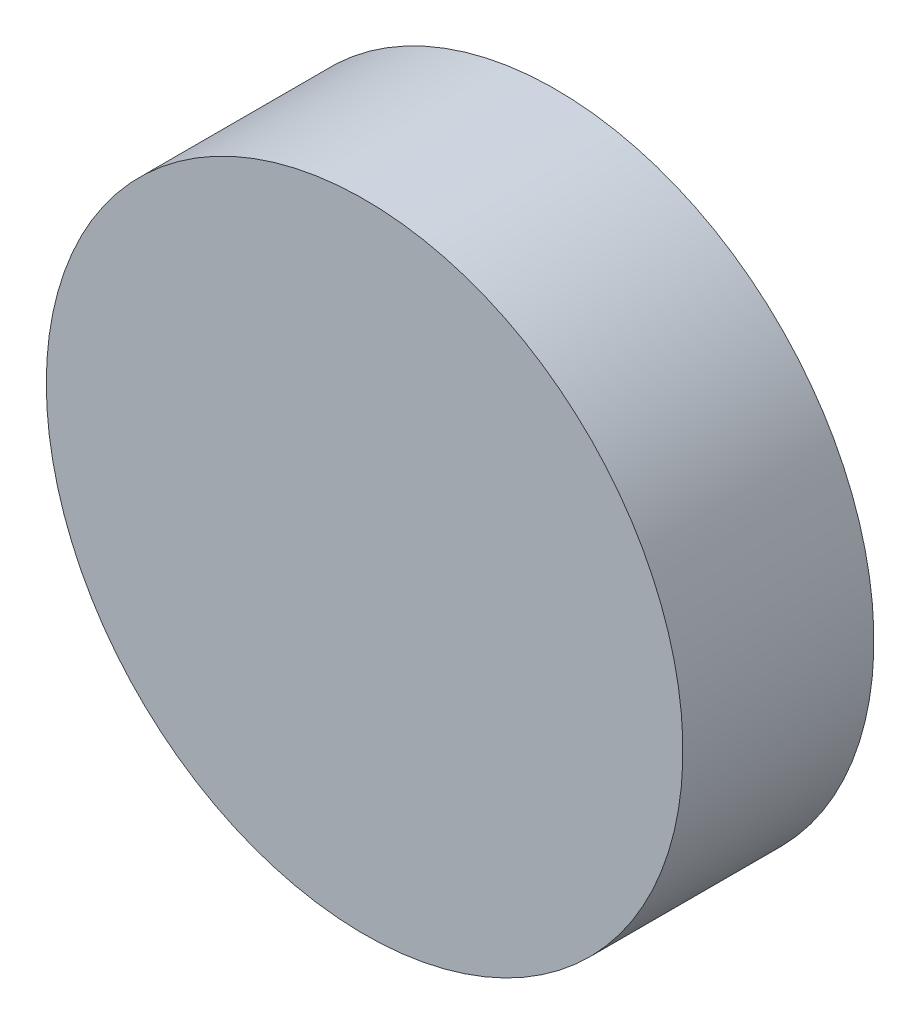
ISO-10303-21;
HEADER;
FILE_DESCRIPTION(('STEP AP214'),'2;1');
FILE_NAME('part.step','',(''),(''),'','','');
FILE_SCHEMA(('AUTOMOTIVE_DESIGN { 1 0 10303 214 1 1 1 1 }'));
ENDSEC;
DATA;
#1=APPLICATION_CONTEXT('core data for automotive mechanical design processes');
#2=APPLICATION_PROTOCOL_DEFINITION('international standard','automotive_design',2000,#1);
#3=PRODUCT_CONTEXT('',#1,'mechanical');
#4=PRODUCT('Part','Part','',(#3));
#5=PRODUCT_RELATED_PRODUCT_CATEGORY('part','',(#4));
#6=PRODUCT_DEFINITION_FORMATION('','',#4);
#7=PRODUCT_DEFINITION_CONTEXT('part definition',#1,'design');
#8=PRODUCT_DEFINITION('design','',#6,#7);
#9=PRODUCT_DEFINITION_SHAPE('','',#8);
#10=(LENGTH_UNIT() NAMED_UNIT(*) SI_UNIT(.MILLI.,.METRE.));
#11=(NAMED_UNIT(*) PLANE_ANGLE_UNIT() SI_UNIT($,.RADIAN.));
#12=(NAMED_UNIT(*) SI_UNIT($,.STERADIAN.) SOLID_ANGLE_UNIT());
#13=UNCERTAINTY_MEASURE_WITH_UNIT(LENGTH_MEASURE(1.E-05),#10,'distance_accuracy_value','');
#14=(GEOMETRIC_REPRESENTATION_CONTEXT(3) GLOBAL_UNCERTAINTY_ASSIGNED_CONTEXT((#13)) GLOBAL_UNIT_ASSIGNED_CONTEXT((#10,
#11,#12)) REPRESENTATION_CONTEXT('',''));
#15=CARTESIAN_POINT('',(0.,0.,0.));
#16=DIRECTION('',(0.,0.,1.));
#17=DIRECTION('',(1.,0.,0.));
#18=AXIS2_PLACEMENT_3D('',#15,#16,#17);
#19=CARTESIAN_POINT('',(0.,0.,9.525));
#20=DIRECTION('',(0.,0.,-1.));
#21=DIRECTION('',(-1.,0.,0.));
#22=AXIS2_PLACEMENT_3D('',#19,#20,#21);
#23=CYLINDRICAL_SURFACE('',#22,15.875);
#24=CARTESIAN_POINT('',(0.,0.,9.525));
#25=DIRECTION('',(0.,0.,1.));
#26=DIRECTION('',(1.,0.,0.));
#27=AXIS2_PLACEMENT_3D('',#24,#25,#26);
#28=CIRCLE('',#27,15.875);
#29=CARTESIAN_POINT('',(-15.875,0.,9.525));
#30=VERTEX_POINT('',#29);
#31=EDGE_CURVE('E10',#30,#30,#28,.T.);
#32=CARTESIAN_POINT('',(0.,0.,0.));
#33=DIRECTION('',(0.,0.,1.));
#34=DIRECTION('',(1.,0.,0.));
#35=AXIS2_PLACEMENT_3D('',#32,#33,#34);
#36=CIRCLE('',#35,15.875);
#37=CARTESIAN_POINT('',(-15.875,0.,0.));
#38=VERTEX_POINT('',#37);
#39=EDGE_CURVE('E43',#38,#38,#36,.T.);
#40=CARTESIAN_POINT('',(-15.875,0.,9.525));
#41=CARTESIAN_POINT('',(-15.875,0.,9.42578125));
#42=CARTESIAN_POINT('',(-15.875,0.,9.3265625));
#43=CARTESIAN_POINT('',(-15.875,0.,9.128125));
#44=CARTESIAN_POINT('',(-15.875,0.,9.02890625));
#45=CARTESIAN_POINT('',(-15.875,0.,8.83046875));
#46=CARTESIAN_POINT('',(-15.875,0.,8.73125));
#47=CARTESIAN_POINT('',(-15.875,0.,8.5328125));
#48=CARTESIAN_POINT('',(-15.875,0.,8.43359375));
#49=CARTESIAN_POINT('',(-15.875,0.,8.23515625));
#50=CARTESIAN_POINT('',(-15.875,0.,8.1359375));
#51=CARTESIAN_POINT('',(-15.875,0.,7.9375));
#52=CARTESIAN_POINT('',(-15.875,0.,7.83828125));
#53=CARTESIAN_POINT('',(-15.875,0.,7.63984375));
#54=CARTESIAN_POINT('',(-15.875,0.,7.540625));
#55=CARTESIAN_POINT('',(-15.875,0.,7.3421875));
#56=CARTESIAN_POINT('',(-15.875,0.,7.24296875));
#57=CARTESIAN_POINT('',(-15.875,0.,7.04453125));
#58=CARTESIAN_POINT('',(-15.875,0.,6.9453125));
#59=CARTESIAN_POINT('',(-15.875,0.,6.746875));
#60=CARTESIAN_POINT('',(-15.875,0.,6.64765625));
#61=CARTESIAN_POINT('',(-15.875,0.,6.44921875));
#62=CARTESIAN_POINT('',(-15.875,0.,6.35));
#63=CARTESIAN_POINT('',(-15.875,0.,6.1515625));
#64=CARTESIAN_POINT('',(-15.875,0.,6.05234375));
#65=CARTESIAN_POINT('',(-15.875,0.,5.85390625));
#66=CARTESIAN_POINT('',(-15.875,0.,5.7546875));
#67=CARTESIAN_POINT('',(-15.875,0.,5.55625));
#68=CARTESIAN_POINT('',(-15.875,0.,5.45703125));
#69=CARTESIAN_POINT('',(-15.875,0.,5.25859375));
#70=CARTESIAN_POINT('',(-15.875,0.,5.159375));
#71=CARTESIAN_POINT('',(-15.875,0.,4.9609375));
#72=CARTESIAN_POINT('',(-15.875,0.,4.86171875));
#73=CARTESIAN_POINT('',(-15.875,0.,4.66328125));
#74=CARTESIAN_POINT('',(-15.875,0.,4.5640625));
#75=CARTESIAN_POINT('',(-15.875,0.,4.365625));
#76=CARTESIAN_POINT('',(-15.875,0.,4.26640625));
#77=CARTESIAN_POINT('',(-15.875,0.,4.06796875));
#78=CARTESIAN_POINT('',(-15.875,0.,3.96875));
#79=CARTESIAN_POINT('',(-15.875,0.,3.7703125));
#80=CARTESIAN_POINT('',(-15.875,0.,3.67109375));
#81=CARTESIAN_POINT('',(-15.875,0.,3.47265625));
#82=CARTESIAN_POINT('',(-15.875,0.,3.3734375));
#83=CARTESIAN_POINT('',(-15.875,0.,3.175));
#84=CARTESIAN_POINT('',(-15.875,0.,3.07578125));
#85=CARTESIAN_POINT('',(-15.875,0.,2.87734375));
#86=CARTESIAN_POINT('',(-15.875,0.,2.778125));
#87=CARTESIAN_POINT('',(-15.875,0.,2.5796875));
#88=CARTESIAN_POINT('',(-15.875,0.,2.48046875));
#89=CARTESIAN_POINT('',(-15.875,0.,2.28203125));
#90=CARTESIAN_POINT('',(-15.875,0.,2.1828125));
#91=CARTESIAN_POINT('',(-15.875,0.,1.984375));
#92=CARTESIAN_POINT('',(-15.875,0.,1.88515625));
#93=CARTESIAN_POINT('',(-15.875,0.,1.68671875));
#94=CARTESIAN_POINT('',(-15.875,0.,1.5875));
#95=CARTESIAN_POINT('',(-15.875,0.,1.3890625));
#96=CARTESIAN_POINT('',(-15.875,0.,1.28984375));
#97=CARTESIAN_POINT('',(-15.875,0.,1.09140625));
#98=CARTESIAN_POINT('',(-15.875,0.,0.992187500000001));
#99=CARTESIAN_POINT('',(-15.875,0.,0.793750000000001));
#100=CARTESIAN_POINT('',(-15.875,0.,0.69453125));
#101=CARTESIAN_POINT('',(-15.875,0.,0.49609375));
#102=CARTESIAN_POINT('',(-15.875,0.,0.396875));
#103=CARTESIAN_POINT('',(-15.875,0.,0.1984375));
#104=CARTESIAN_POINT('',(-15.875,0.,0.0992187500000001));
#105=CARTESIAN_POINT('',(-15.875,0.,0.));
#106=B_SPLINE_CURVE_WITH_KNOTS('',3,(#40,#41,#42,#43,#44,#45,#46,#47,#48,#49,#50,#51,#52,#53,
#54,#55,#56,#57,#58,#59,#60,#61,#62,#63,#64,#65,#66,#67,#68,#69,#70,#71,#72,#73,#74,#75,#76,#77,
#78,#79,#80,#81,#82,#83,#84,#85,#86,#87,#88,#89,#90,#91,#92,#93,#94,#95,#96,#97,#98,#99,#100,
#101,#102,#103,#104,#105),.UNSPECIFIED.,.F.,.F.,(4,2,2,2,2,2,2,2,2,2,2,2,2,2,2,2,2,2,2,2,2,2,2,
2,2,2,2,2,2,2,2,2,4),(0.,0.297656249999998,0.595312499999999,0.892968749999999,1.190625,
1.48828125,1.7859375,2.08359375,2.38125,2.67890625,2.9765625,3.27421875,3.571875,3.86953125,
4.1671875,4.46484375,4.7625,5.06015625,5.3578125,5.65546875,5.953125,6.25078125,6.5484375,
6.84609375,7.14375,7.44140625,7.7390625,8.03671875,8.334375,8.63203125,8.9296875,9.22734375,
9.525),.UNSPECIFIED.);
#107=EDGE_CURVE('BSEAM37',#30,#38,#106,.T.);
#108=ORIENTED_EDGE('',*,*,#31,.F.);
#109=ORIENTED_EDGE('',*,*,#39,.T.);
#110=ORIENTED_EDGE('',*,*,#107,.T.);
#111=ORIENTED_EDGE('',*,*,#107,.F.);
#112=EDGE_LOOP('',(#108,#110,#109,#111));
#113=FACE_BOUND('',#112,.T.);
#114=ADVANCED_FACE('F37',(#113),#23,.T.);
#115=CARTESIAN_POINT('',(0.,0.,9.525));
#116=DIRECTION('',(0.,0.,1.));
#117=DIRECTION('',(1.,0.,0.));
#118=AXIS2_PLACEMENT_3D('',#115,#116,#117);
#119=PLANE('',#118);
#120=ORIENTED_EDGE('',*,*,#31,.T.);
#121=EDGE_LOOP('',(#120));
#122=FACE_BOUND('',#121,.T.);
#123=ADVANCED_FACE('F52',(#122),#119,.T.);
#124=CARTESIAN_POINT('',(0.,0.,0.));
#125=DIRECTION('',(0.,0.,1.));
#126=DIRECTION('',(1.,0.,0.));
#127=AXIS2_PLACEMENT_3D('',#124,#125,#126);
#128=PLANE('',#127);
#129=ORIENTED_EDGE('',*,*,#39,.F.);
#130=EDGE_LOOP('',(#129));
#131=FACE_BOUND('',#130,.T.);
#132=ADVANCED_FACE('F50',(#131),#128,.F.);
#133=CLOSED_SHELL('',(#114,#123,#132));
#134=MANIFOLD_SOLID_BREP('B2',#133);
#135=ADVANCED_BREP_SHAPE_REPRESENTATION('',(#18,#134),#14);
#136=SHAPE_DEFINITION_REPRESENTATION(#9,#135);
ENDSEC;
END-ISO-10303-21;
